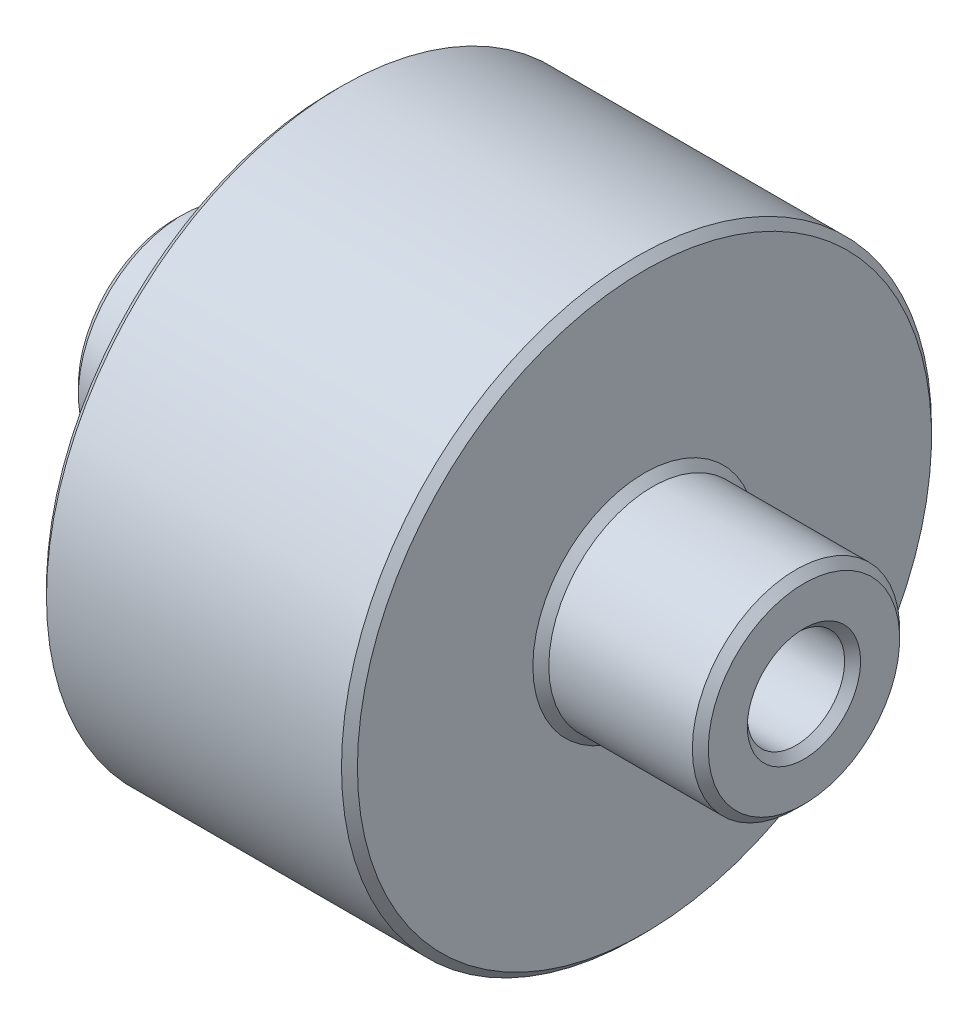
from build123d import *

# Parameters (mm, degrees)
CHAMFER_1_SIZE = 0.5


with BuildPart() as part:
    # Sketch 1 → Revolve 1 (revolve)
    with BuildSketch(Plane.XY, mode=Mode.PRIVATE) as revolve_1_sk:
        Polygon((0, 3.05), (39.5, 3.05), (39.5, 6.5), (29.5, 6.5), (29.5, 18.5), (10, 18.5), (10, 6.5), (0, 6.5), align=None)
    revolve(revolve_1_sk.sketch.rotate(Axis((0, 0, 0), (1, 0, 0)), 90), axis=Axis((0, 0, 0), (1, 0, 0)))

    # Chamfer 1
    chamfer_1_edges = [part.edges().sort_by_distance(p)[0] for p in [
        (0, 0, -6.5),
        (10, 0, -6.5),
        (10, 0, -18.5),
        (29.5, 0, -18.5),
        (29.5, 0, -6.5),
        (39.5, 0, -6.5),
        (39.5, 0, -3.05),
        (0, 0, -3.05),
    ]]
    chamfer(chamfer_1_edges, length=CHAMFER_1_SIZE)


solid = part.part
